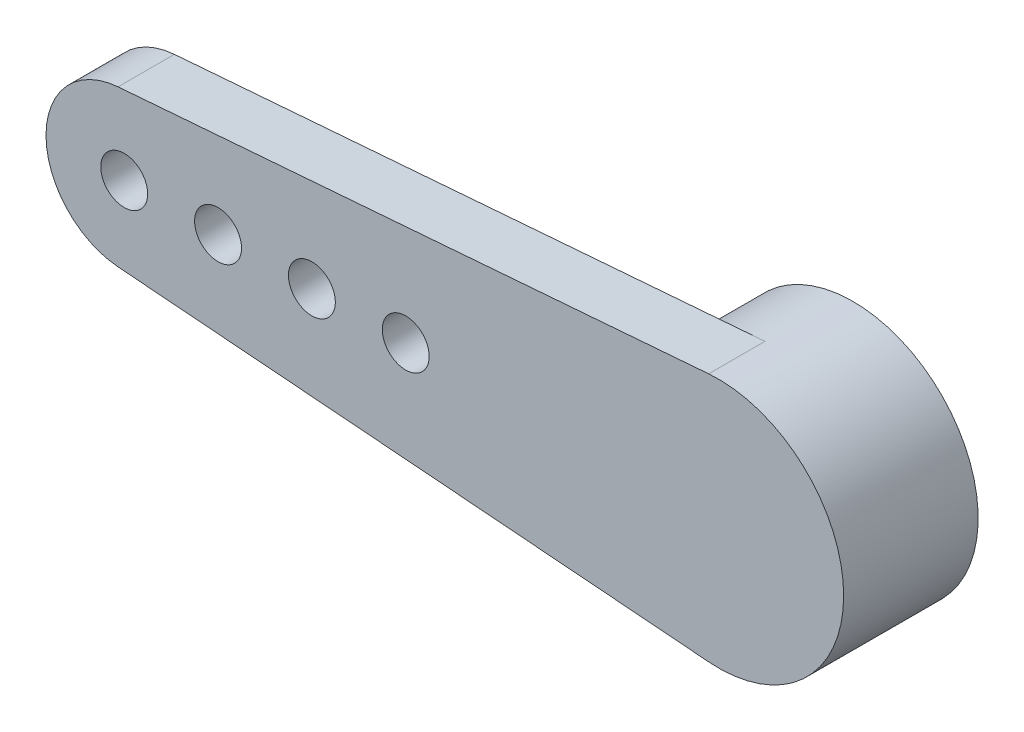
ISO-10303-21;
HEADER;
FILE_DESCRIPTION(('STEP AP214'),'2;1');
FILE_NAME('part.step','',(''),(''),'','','');
FILE_SCHEMA(('AUTOMOTIVE_DESIGN { 1 0 10303 214 1 1 1 1 }'));
ENDSEC;
DATA;
#1=APPLICATION_CONTEXT('core data for automotive mechanical design processes');
#2=APPLICATION_PROTOCOL_DEFINITION('international standard','automotive_design',2000,#1);
#3=PRODUCT_CONTEXT('',#1,'mechanical');
#4=PRODUCT('Part','Part','',(#3));
#5=PRODUCT_RELATED_PRODUCT_CATEGORY('part','',(#4));
#6=PRODUCT_DEFINITION_FORMATION('','',#4);
#7=PRODUCT_DEFINITION_CONTEXT('part definition',#1,'design');
#8=PRODUCT_DEFINITION('design','',#6,#7);
#9=PRODUCT_DEFINITION_SHAPE('','',#8);
#10=(LENGTH_UNIT() NAMED_UNIT(*) SI_UNIT(.MILLI.,.METRE.));
#11=(NAMED_UNIT(*) PLANE_ANGLE_UNIT() SI_UNIT($,.RADIAN.));
#12=(NAMED_UNIT(*) SI_UNIT($,.STERADIAN.) SOLID_ANGLE_UNIT());
#13=UNCERTAINTY_MEASURE_WITH_UNIT(LENGTH_MEASURE(1.E-05),#10,'distance_accuracy_value','');
#14=(GEOMETRIC_REPRESENTATION_CONTEXT(3) GLOBAL_UNCERTAINTY_ASSIGNED_CONTEXT((#13)) GLOBAL_UNIT_ASSIGNED_CONTEXT((#10,
#11,#12)) REPRESENTATION_CONTEXT('',''));
#15=CARTESIAN_POINT('',(0.,0.,0.));
#16=DIRECTION('',(0.,0.,1.));
#17=DIRECTION('',(1.,0.,0.));
#18=AXIS2_PLACEMENT_3D('',#15,#16,#17);
#19=CARTESIAN_POINT('',(0.,0.,0.));
#20=DIRECTION('',(0.,0.,1.));
#21=DIRECTION('',(1.,0.,0.));
#22=AXIS2_PLACEMENT_3D('',#19,#20,#21);
#23=PLANE('',#22);
#24=CARTESIAN_POINT('',(-13.,0.,0.));
#25=DIRECTION('',(0.,0.,1.));
#26=DIRECTION('',(1.,0.,0.));
#27=AXIS2_PLACEMENT_3D('',#24,#25,#26);
#28=CIRCLE('',#27,0.75);
#29=CARTESIAN_POINT('',(-12.25,0.,0.));
#30=VERTEX_POINT('',#29);
#31=EDGE_CURVE('E136',#30,#30,#28,.T.);
#32=ORIENTED_EDGE('',*,*,#31,.T.);
#33=EDGE_LOOP('',(#32));
#34=FACE_BOUND('',#33,.T.);
#35=CARTESIAN_POINT('',(-19.,0.,0.));
#36=DIRECTION('',(0.,0.,1.));
#37=DIRECTION('',(1.,0.,0.));
#38=AXIS2_PLACEMENT_3D('',#35,#36,#37);
#39=CIRCLE('',#38,0.750000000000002);
#40=CARTESIAN_POINT('',(-18.25,0.,0.));
#41=VERTEX_POINT('',#40);
#42=EDGE_CURVE('E124',#41,#41,#39,.T.);
#43=ORIENTED_EDGE('',*,*,#42,.T.);
#44=EDGE_LOOP('',(#43));
#45=FACE_BOUND('',#44,.T.);
#46=CARTESIAN_POINT('',(-10.,0.,0.));
#47=DIRECTION('',(0.,0.,1.));
#48=DIRECTION('',(1.,0.,0.));
#49=AXIS2_PLACEMENT_3D('',#46,#47,#48);
#50=CIRCLE('',#49,0.75);
#51=CARTESIAN_POINT('',(-9.25,0.,0.));
#52=VERTEX_POINT('',#51);
#53=EDGE_CURVE('E118',#52,#52,#50,.T.);
#54=ORIENTED_EDGE('',*,*,#53,.T.);
#55=EDGE_LOOP('',(#54));
#56=FACE_BOUND('',#55,.T.);
#57=CARTESIAN_POINT('',(-16.,0.,0.));
#58=DIRECTION('',(0.,0.,1.));
#59=DIRECTION('',(1.,0.,0.));
#60=AXIS2_PLACEMENT_3D('',#57,#58,#59);
#61=CIRCLE('',#60,0.750000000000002);
#62=CARTESIAN_POINT('',(-15.25,0.,0.));
#63=VERTEX_POINT('',#62);
#64=EDGE_CURVE('E130',#63,#63,#61,.T.);
#65=ORIENTED_EDGE('',*,*,#64,.T.);
#66=EDGE_LOOP('',(#65));
#67=FACE_BOUND('',#66,.T.);
#68=CARTESIAN_POINT('',(0.,0.,0.));
#69=DIRECTION('',(0.,0.,-1.));
#70=DIRECTION('',(-1.,0.,0.));
#71=AXIS2_PLACEMENT_3D('',#68,#69,#70);
#72=CIRCLE('',#71,4.);
#73=CARTESIAN_POINT('',(-0.31578947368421,-3.98751514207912,0.));
#74=VERTEX_POINT('',#73);
#75=CARTESIAN_POINT('',(-0.315789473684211,3.98751514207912,0.));
#76=VERTEX_POINT('',#75);
#77=EDGE_CURVE('E11',#74,#76,#72,.T.);
#78=ORIENTED_EDGE('',*,*,#77,.F.);
#79=DIRECTION('',(0.99687878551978,-0.0789473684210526,0.));
#80=VECTOR('',#79,1.);
#81=CARTESIAN_POINT('',(-19.1973684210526,-2.49219696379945,0.));
#82=LINE('',#81,#80);
#83=CARTESIAN_POINT('',(-19.1973684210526,-2.49219696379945,0.));
#84=VERTEX_POINT('',#83);
#85=EDGE_CURVE('E105',#84,#74,#82,.T.);
#86=ORIENTED_EDGE('',*,*,#85,.F.);
#87=CARTESIAN_POINT('',(-19.,0.,0.));
#88=DIRECTION('',(0.,0.,1.));
#89=DIRECTION('',(1.,0.,0.));
#90=AXIS2_PLACEMENT_3D('',#87,#88,#89);
#91=CIRCLE('',#90,2.5);
#92=CARTESIAN_POINT('',(-19.1973684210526,2.49219696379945,0.));
#93=VERTEX_POINT('',#92);
#94=EDGE_CURVE('E68',#93,#84,#91,.T.);
#95=ORIENTED_EDGE('',*,*,#94,.F.);
#96=DIRECTION('',(-0.99687878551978,-0.0789473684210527,0.));
#97=VECTOR('',#96,1.);
#98=CARTESIAN_POINT('',(-19.1973684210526,2.49219696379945,0.));
#99=LINE('',#98,#97);
#100=EDGE_CURVE('E86',#76,#93,#99,.T.);
#101=ORIENTED_EDGE('',*,*,#100,.F.);
#102=EDGE_LOOP('',(#78,#86,#95,#101));
#103=FACE_BOUND('',#102,.T.);
#104=ADVANCED_FACE('F34',(#34,#45,#56,#67,#103),#23,.F.);
#105=CARTESIAN_POINT('',(0.,0.,1.8));
#106=DIRECTION('',(0.,0.,1.));
#107=DIRECTION('',(1.,0.,0.));
#108=AXIS2_PLACEMENT_3D('',#105,#106,#107);
#109=PLANE('',#108);
#110=CARTESIAN_POINT('',(-16.,0.,1.8));
#111=DIRECTION('',(0.,0.,1.));
#112=DIRECTION('',(1.,0.,0.));
#113=AXIS2_PLACEMENT_3D('',#110,#111,#112);
#114=CIRCLE('',#113,0.750000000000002);
#115=CARTESIAN_POINT('',(-15.25,0.,1.8));
#116=VERTEX_POINT('',#115);
#117=EDGE_CURVE('E127',#116,#116,#114,.T.);
#118=ORIENTED_EDGE('',*,*,#117,.F.);
#119=EDGE_LOOP('',(#118));
#120=FACE_BOUND('',#119,.T.);
#121=CARTESIAN_POINT('',(-10.,0.,1.8));
#122=DIRECTION('',(0.,0.,1.));
#123=DIRECTION('',(1.,0.,0.));
#124=AXIS2_PLACEMENT_3D('',#121,#122,#123);
#125=CIRCLE('',#124,0.75);
#126=CARTESIAN_POINT('',(-9.25,0.,1.8));
#127=VERTEX_POINT('',#126);
#128=EDGE_CURVE('E91',#127,#127,#125,.T.);
#129=ORIENTED_EDGE('',*,*,#128,.F.);
#130=EDGE_LOOP('',(#129));
#131=FACE_BOUND('',#130,.T.);
#132=CARTESIAN_POINT('',(0.,0.,1.8));
#133=DIRECTION('',(0.,0.,1.));
#134=DIRECTION('',(1.,0.,0.));
#135=AXIS2_PLACEMENT_3D('',#132,#133,#134);
#136=CIRCLE('',#135,4.);
#137=CARTESIAN_POINT('',(-0.31578947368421,-3.98751514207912,1.8));
#138=VERTEX_POINT('',#137);
#139=CARTESIAN_POINT('',(-0.315789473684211,3.98751514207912,1.8));
#140=VERTEX_POINT('',#139);
#141=EDGE_CURVE('E96',#138,#140,#136,.T.);
#142=ORIENTED_EDGE('',*,*,#141,.T.);
#143=DIRECTION('',(-0.99687878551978,-0.0789473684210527,0.));
#144=VECTOR('',#143,1.);
#145=CARTESIAN_POINT('',(-19.1973684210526,2.49219696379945,1.8));
#146=LINE('',#145,#144);
#147=CARTESIAN_POINT('',(-19.1973684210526,2.49219696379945,1.8));
#148=VERTEX_POINT('',#147);
#149=EDGE_CURVE('E82',#140,#148,#146,.T.);
#150=ORIENTED_EDGE('',*,*,#149,.T.);
#151=CARTESIAN_POINT('',(-19.,0.,1.8));
#152=DIRECTION('',(0.,0.,1.));
#153=DIRECTION('',(1.,0.,0.));
#154=AXIS2_PLACEMENT_3D('',#151,#152,#153);
#155=CIRCLE('',#154,2.5);
#156=CARTESIAN_POINT('',(-19.1973684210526,-2.49219696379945,1.8));
#157=VERTEX_POINT('',#156);
#158=EDGE_CURVE('E100',#148,#157,#155,.T.);
#159=ORIENTED_EDGE('',*,*,#158,.T.);
#160=DIRECTION('',(0.99687878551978,-0.0789473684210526,0.));
#161=VECTOR('',#160,1.);
#162=CARTESIAN_POINT('',(-19.1973684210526,-2.49219696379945,1.8));
#163=LINE('',#162,#161);
#164=EDGE_CURVE('E53',#157,#138,#163,.T.);
#165=ORIENTED_EDGE('',*,*,#164,.T.);
#166=EDGE_LOOP('',(#142,#150,#159,#165));
#167=FACE_BOUND('',#166,.T.);
#168=CARTESIAN_POINT('',(-19.,0.,1.8));
#169=DIRECTION('',(0.,0.,1.));
#170=DIRECTION('',(1.,0.,0.));
#171=AXIS2_PLACEMENT_3D('',#168,#169,#170);
#172=CIRCLE('',#171,0.750000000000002);
#173=CARTESIAN_POINT('',(-18.25,0.,1.8));
#174=VERTEX_POINT('',#173);
#175=EDGE_CURVE('E121',#174,#174,#172,.T.);
#176=ORIENTED_EDGE('',*,*,#175,.F.);
#177=EDGE_LOOP('',(#176));
#178=FACE_BOUND('',#177,.T.);
#179=CARTESIAN_POINT('',(-13.,0.,1.8));
#180=DIRECTION('',(0.,0.,1.));
#181=DIRECTION('',(1.,0.,0.));
#182=AXIS2_PLACEMENT_3D('',#179,#180,#181);
#183=CIRCLE('',#182,0.75);
#184=CARTESIAN_POINT('',(-12.25,0.,1.8));
#185=VERTEX_POINT('',#184);
#186=EDGE_CURVE('E133',#185,#185,#183,.T.);
#187=ORIENTED_EDGE('',*,*,#186,.F.);
#188=EDGE_LOOP('',(#187));
#189=FACE_BOUND('',#188,.T.);
#190=ADVANCED_FACE('F166',(#120,#131,#167,#178,#189),#109,.T.);
#191=CARTESIAN_POINT('',(0.,0.,1.8));
#192=DIRECTION('',(0.,0.,-1.));
#193=DIRECTION('',(-1.,0.,0.));
#194=AXIS2_PLACEMENT_3D('',#191,#192,#193);
#195=CYLINDRICAL_SURFACE('',#194,4.);
#196=DIRECTION('',(0.,0.,-1.));
#197=VECTOR('',#196,1.);
#198=CARTESIAN_POINT('',(-0.31578947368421,-3.98751514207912,1.8));
#199=LINE('',#198,#197);
#200=EDGE_CURVE('E95',#138,#74,#199,.T.);
#201=ORIENTED_EDGE('',*,*,#200,.T.);
#202=ORIENTED_EDGE('',*,*,#77,.T.);
#203=DIRECTION('',(0.,0.,-1.));
#204=VECTOR('',#203,1.);
#205=CARTESIAN_POINT('',(-0.315789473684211,3.98751514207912,1.8));
#206=LINE('',#205,#204);
#207=EDGE_CURVE('E44',#140,#76,#206,.T.);
#208=ORIENTED_EDGE('',*,*,#207,.F.);
#209=ORIENTED_EDGE('',*,*,#141,.F.);
#210=EDGE_LOOP('',(#201,#202,#208,#209));
#211=FACE_BOUND('',#210,.T.);
#212=CARTESIAN_POINT('',(0.,0.,-2.5));
#213=DIRECTION('',(0.,0.,-1.));
#214=DIRECTION('',(-1.,0.,0.));
#215=AXIS2_PLACEMENT_3D('',#212,#213,#214);
#216=CIRCLE('',#215,4.);
#217=CARTESIAN_POINT('',(-4.,0.,-2.5));
#218=VERTEX_POINT('',#217);
#219=EDGE_CURVE('E139',#218,#218,#216,.T.);
#220=ORIENTED_EDGE('',*,*,#219,.F.);
#221=EDGE_LOOP('',(#220));
#222=FACE_BOUND('',#221,.T.);
#223=ADVANCED_FACE('F36',(#211,#222),#195,.T.);
#224=CARTESIAN_POINT('',(-19.1973684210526,2.49219696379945,1.8));
#225=DIRECTION('',(0.0789473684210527,-0.99687878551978,0.));
#226=DIRECTION('',(0.99687878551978,0.0789473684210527,0.));
#227=AXIS2_PLACEMENT_3D('',#224,#225,#226);
#228=PLANE('',#227);
#229=ORIENTED_EDGE('',*,*,#100,.T.);
#230=DIRECTION('',(0.,0.,-1.));
#231=VECTOR('',#230,1.);
#232=CARTESIAN_POINT('',(-19.1973684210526,2.49219696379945,1.8));
#233=LINE('',#232,#231);
#234=EDGE_CURVE('E89',#148,#93,#233,.T.);
#235=ORIENTED_EDGE('',*,*,#234,.F.);
#236=ORIENTED_EDGE('',*,*,#149,.F.);
#237=ORIENTED_EDGE('',*,*,#207,.T.);
#238=EDGE_LOOP('',(#229,#235,#236,#237));
#239=FACE_BOUND('',#238,.T.);
#240=ADVANCED_FACE('F85',(#239),#228,.F.);
#241=CARTESIAN_POINT('',(-19.,0.,1.8));
#242=DIRECTION('',(0.,0.,-1.));
#243=DIRECTION('',(-1.,0.,0.));
#244=AXIS2_PLACEMENT_3D('',#241,#242,#243);
#245=CYLINDRICAL_SURFACE('',#244,2.5);
#246=ORIENTED_EDGE('',*,*,#94,.T.);
#247=DIRECTION('',(0.,0.,-1.));
#248=VECTOR('',#247,1.);
#249=CARTESIAN_POINT('',(-19.1973684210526,-2.49219696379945,1.8));
#250=LINE('',#249,#248);
#251=EDGE_CURVE('E98',#157,#84,#250,.T.);
#252=ORIENTED_EDGE('',*,*,#251,.F.);
#253=ORIENTED_EDGE('',*,*,#158,.F.);
#254=ORIENTED_EDGE('',*,*,#234,.T.);
#255=EDGE_LOOP('',(#246,#252,#253,#254));
#256=FACE_BOUND('',#255,.T.);
#257=ADVANCED_FACE('F171',(#256),#245,.T.);
#258=CARTESIAN_POINT('',(-19.1973684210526,-2.49219696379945,1.8));
#259=DIRECTION('',(0.0789473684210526,0.99687878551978,0.));
#260=DIRECTION('',(-0.99687878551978,0.0789473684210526,0.));
#261=AXIS2_PLACEMENT_3D('',#258,#259,#260);
#262=PLANE('',#261);
#263=ORIENTED_EDGE('',*,*,#85,.T.);
#264=ORIENTED_EDGE('',*,*,#200,.F.);
#265=ORIENTED_EDGE('',*,*,#164,.F.);
#266=ORIENTED_EDGE('',*,*,#251,.T.);
#267=EDGE_LOOP('',(#263,#264,#265,#266));
#268=FACE_BOUND('',#267,.T.);
#269=ADVANCED_FACE('F182',(#268),#262,.F.);
#270=CARTESIAN_POINT('',(-10.,0.,1.8));
#271=DIRECTION('',(0.,0.,-1.));
#272=DIRECTION('',(-1.,0.,0.));
#273=AXIS2_PLACEMENT_3D('',#270,#271,#272);
#274=CYLINDRICAL_SURFACE('',#273,0.75);
#275=ORIENTED_EDGE('',*,*,#128,.T.);
#276=EDGE_LOOP('',(#275));
#277=FACE_BOUND('',#276,.T.);
#278=ORIENTED_EDGE('',*,*,#53,.F.);
#279=EDGE_LOOP('',(#278));
#280=FACE_BOUND('',#279,.T.);
#281=ADVANCED_FACE('F185',(#277,#280),#274,.F.);
#282=CARTESIAN_POINT('',(-19.,0.,1.8));
#283=DIRECTION('',(0.,0.,-1.));
#284=DIRECTION('',(-1.,0.,0.));
#285=AXIS2_PLACEMENT_3D('',#282,#283,#284);
#286=CYLINDRICAL_SURFACE('',#285,0.750000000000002);
#287=ORIENTED_EDGE('',*,*,#175,.T.);
#288=EDGE_LOOP('',(#287));
#289=FACE_BOUND('',#288,.T.);
#290=ORIENTED_EDGE('',*,*,#42,.F.);
#291=EDGE_LOOP('',(#290));
#292=FACE_BOUND('',#291,.T.);
#293=ADVANCED_FACE('F203',(#289,#292),#286,.F.);
#294=CARTESIAN_POINT('',(-16.,0.,1.8));
#295=DIRECTION('',(0.,0.,-1.));
#296=DIRECTION('',(-1.,0.,0.));
#297=AXIS2_PLACEMENT_3D('',#294,#295,#296);
#298=CYLINDRICAL_SURFACE('',#297,0.750000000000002);
#299=ORIENTED_EDGE('',*,*,#117,.T.);
#300=EDGE_LOOP('',(#299));
#301=FACE_BOUND('',#300,.T.);
#302=ORIENTED_EDGE('',*,*,#64,.F.);
#303=EDGE_LOOP('',(#302));
#304=FACE_BOUND('',#303,.T.);
#305=ADVANCED_FACE('F210',(#301,#304),#298,.F.);
#306=CARTESIAN_POINT('',(-13.,0.,1.8));
#307=DIRECTION('',(0.,0.,-1.));
#308=DIRECTION('',(-1.,0.,0.));
#309=AXIS2_PLACEMENT_3D('',#306,#307,#308);
#310=CYLINDRICAL_SURFACE('',#309,0.75);
#311=ORIENTED_EDGE('',*,*,#186,.T.);
#312=EDGE_LOOP('',(#311));
#313=FACE_BOUND('',#312,.T.);
#314=ORIENTED_EDGE('',*,*,#31,.F.);
#315=EDGE_LOOP('',(#314));
#316=FACE_BOUND('',#315,.T.);
#317=ADVANCED_FACE('F162',(#313,#316),#310,.F.);
#318=CARTESIAN_POINT('',(0.,0.,-2.5));
#319=DIRECTION('',(0.,0.,-1.));
#320=DIRECTION('',(-1.,0.,0.));
#321=AXIS2_PLACEMENT_3D('',#318,#319,#320);
#322=PLANE('',#321);
#323=CARTESIAN_POINT('',(0.,0.,-2.5));
#324=DIRECTION('',(0.,0.,-1.));
#325=DIRECTION('',(-1.,0.,0.));
#326=AXIS2_PLACEMENT_3D('',#323,#324,#325);
#327=CIRCLE('',#326,2.5);
#328=CARTESIAN_POINT('',(-2.5,0.,-2.5));
#329=VERTEX_POINT('',#328);
#330=EDGE_CURVE('E145',#329,#329,#327,.T.);
#331=ORIENTED_EDGE('',*,*,#330,.F.);
#332=EDGE_LOOP('',(#331));
#333=FACE_BOUND('',#332,.T.);
#334=ORIENTED_EDGE('',*,*,#219,.T.);
#335=EDGE_LOOP('',(#334));
#336=FACE_BOUND('',#335,.T.);
#337=ADVANCED_FACE('F156',(#333,#336),#322,.T.);
#338=CARTESIAN_POINT('',(0.,0.,0.2));
#339=DIRECTION('',(0.,0.,-1.));
#340=DIRECTION('',(-1.,0.,0.));
#341=AXIS2_PLACEMENT_3D('',#338,#339,#340);
#342=CYLINDRICAL_SURFACE('',#341,2.5);
#343=CARTESIAN_POINT('',(0.,0.,0.2));
#344=DIRECTION('',(0.,0.,-1.));
#345=DIRECTION('',(-1.,0.,0.));
#346=AXIS2_PLACEMENT_3D('',#343,#344,#345);
#347=CIRCLE('',#346,2.5);
#348=CARTESIAN_POINT('',(-2.5,0.,0.2));
#349=VERTEX_POINT('',#348);
#350=EDGE_CURVE('E144',#349,#349,#347,.T.);
#351=CARTESIAN_POINT('',(-2.5,0.,0.2));
#352=CARTESIAN_POINT('',(-2.5,0.,0.171875));
#353=CARTESIAN_POINT('',(-2.5,0.,0.14375));
#354=CARTESIAN_POINT('',(-2.5,0.,0.0875000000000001));
#355=CARTESIAN_POINT('',(-2.5,0.,0.0593750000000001));
#356=CARTESIAN_POINT('',(-2.5,0.,0.00312500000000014));
#357=CARTESIAN_POINT('',(-2.5,0.,-0.0249999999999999));
#358=CARTESIAN_POINT('',(-2.5,0.,-0.0812499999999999));
#359=CARTESIAN_POINT('',(-2.5,0.,-0.109375));
#360=CARTESIAN_POINT('',(-2.5,0.,-0.165625));
#361=CARTESIAN_POINT('',(-2.5,0.,-0.19375));
#362=CARTESIAN_POINT('',(-2.5,0.,-0.25));
#363=CARTESIAN_POINT('',(-2.5,0.,-0.278125));
#364=CARTESIAN_POINT('',(-2.5,0.,-0.334375));
#365=CARTESIAN_POINT('',(-2.5,0.,-0.3625));
#366=CARTESIAN_POINT('',(-2.5,0.,-0.41875));
#367=CARTESIAN_POINT('',(-2.5,0.,-0.446875));
#368=CARTESIAN_POINT('',(-2.5,0.,-0.503125));
#369=CARTESIAN_POINT('',(-2.5,0.,-0.53125));
#370=CARTESIAN_POINT('',(-2.5,0.,-0.5875));
#371=CARTESIAN_POINT('',(-2.5,0.,-0.615625));
#372=CARTESIAN_POINT('',(-2.5,0.,-0.671875));
#373=CARTESIAN_POINT('',(-2.5,0.,-0.7));
#374=CARTESIAN_POINT('',(-2.5,0.,-0.75625));
#375=CARTESIAN_POINT('',(-2.5,0.,-0.784375));
#376=CARTESIAN_POINT('',(-2.5,0.,-0.840625));
#377=CARTESIAN_POINT('',(-2.5,0.,-0.86875));
#378=CARTESIAN_POINT('',(-2.5,0.,-0.925));
#379=CARTESIAN_POINT('',(-2.5,0.,-0.953125));
#380=CARTESIAN_POINT('',(-2.5,0.,-1.009375));
#381=CARTESIAN_POINT('',(-2.5,0.,-1.0375));
#382=CARTESIAN_POINT('',(-2.5,0.,-1.09375));
#383=CARTESIAN_POINT('',(-2.5,0.,-1.121875));
#384=CARTESIAN_POINT('',(-2.5,0.,-1.178125));
#385=CARTESIAN_POINT('',(-2.5,0.,-1.20625));
#386=CARTESIAN_POINT('',(-2.5,0.,-1.2625));
#387=CARTESIAN_POINT('',(-2.5,0.,-1.290625));
#388=CARTESIAN_POINT('',(-2.5,0.,-1.346875));
#389=CARTESIAN_POINT('',(-2.5,0.,-1.375));
#390=CARTESIAN_POINT('',(-2.5,0.,-1.43125));
#391=CARTESIAN_POINT('',(-2.5,0.,-1.459375));
#392=CARTESIAN_POINT('',(-2.5,0.,-1.515625));
#393=CARTESIAN_POINT('',(-2.5,0.,-1.54375));
#394=CARTESIAN_POINT('',(-2.5,0.,-1.6));
#395=CARTESIAN_POINT('',(-2.5,0.,-1.628125));
#396=CARTESIAN_POINT('',(-2.5,0.,-1.684375));
#397=CARTESIAN_POINT('',(-2.5,0.,-1.7125));
#398=CARTESIAN_POINT('',(-2.5,0.,-1.76875));
#399=CARTESIAN_POINT('',(-2.5,0.,-1.796875));
#400=CARTESIAN_POINT('',(-2.5,0.,-1.853125));
#401=CARTESIAN_POINT('',(-2.5,0.,-1.88125));
#402=CARTESIAN_POINT('',(-2.5,0.,-1.9375));
#403=CARTESIAN_POINT('',(-2.5,0.,-1.965625));
#404=CARTESIAN_POINT('',(-2.5,0.,-2.021875));
#405=CARTESIAN_POINT('',(-2.5,0.,-2.05));
#406=CARTESIAN_POINT('',(-2.5,0.,-2.10625));
#407=CARTESIAN_POINT('',(-2.5,0.,-2.134375));
#408=CARTESIAN_POINT('',(-2.5,0.,-2.190625));
#409=CARTESIAN_POINT('',(-2.5,0.,-2.21875));
#410=CARTESIAN_POINT('',(-2.5,0.,-2.275));
#411=CARTESIAN_POINT('',(-2.5,0.,-2.303125));
#412=CARTESIAN_POINT('',(-2.5,0.,-2.359375));
#413=CARTESIAN_POINT('',(-2.5,0.,-2.3875));
#414=CARTESIAN_POINT('',(-2.5,0.,-2.44375));
#415=CARTESIAN_POINT('',(-2.5,0.,-2.471875));
#416=CARTESIAN_POINT('',(-2.5,0.,-2.5));
#417=B_SPLINE_CURVE_WITH_KNOTS('',3,(#351,#352,#353,#354,#355,#356,#357,#358,#359,#360,#361,
#362,#363,#364,#365,#366,#367,#368,#369,#370,#371,#372,#373,#374,#375,#376,#377,#378,#379,#380,
#381,#382,#383,#384,#385,#386,#387,#388,#389,#390,#391,#392,#393,#394,#395,#396,#397,#398,#399,
#400,#401,#402,#403,#404,#405,#406,#407,#408,#409,#410,#411,#412,#413,#414,#415,#416),
.UNSPECIFIED.,.F.,.F.,(4,2,2,2,2,2,2,2,2,2,2,2,2,2,2,2,2,2,2,2,2,2,2,2,2,2,2,2,2,2,2,2,4),(0.,
0.084375,0.16875,0.253125,0.3375,0.421875,0.50625,0.590625,0.675,0.759375,0.84375,0.928125,
1.0125,1.096875,1.18125,1.265625,1.35,1.434375,1.51875,1.603125,1.6875,1.771875,1.85625,
1.940625,2.025,2.109375,2.19375,2.278125,2.3625,2.446875,2.53125,2.615625,2.7),.UNSPECIFIED.);
#418=EDGE_CURVE('BSEAM153',#349,#329,#417,.T.);
#419=ORIENTED_EDGE('',*,*,#350,.F.);
#420=ORIENTED_EDGE('',*,*,#330,.T.);
#421=ORIENTED_EDGE('',*,*,#418,.T.);
#422=ORIENTED_EDGE('',*,*,#418,.F.);
#423=EDGE_LOOP('',(#419,#421,#420,#422));
#424=FACE_BOUND('',#423,.T.);
#425=ADVANCED_FACE('F153',(#424),#342,.F.);
#426=CARTESIAN_POINT('',(0.,0.,0.2));
#427=DIRECTION('',(0.,0.,-1.));
#428=DIRECTION('',(-1.,0.,0.));
#429=AXIS2_PLACEMENT_3D('',#426,#427,#428);
#430=PLANE('',#429);
#431=ORIENTED_EDGE('',*,*,#350,.T.);
#432=EDGE_LOOP('',(#431));
#433=FACE_BOUND('',#432,.T.);
#434=ADVANCED_FACE('F151',(#433),#430,.T.);
#435=CLOSED_SHELL('',(#104,#190,#223,#240,#257,#269,#281,#293,#305,#317,#337,#425,#434));
#436=MANIFOLD_SOLID_BREP('B2',#435);
#437=ADVANCED_BREP_SHAPE_REPRESENTATION('',(#18,#436),#14);
#438=SHAPE_DEFINITION_REPRESENTATION(#9,#437);
ENDSEC;
END-ISO-10303-21;
